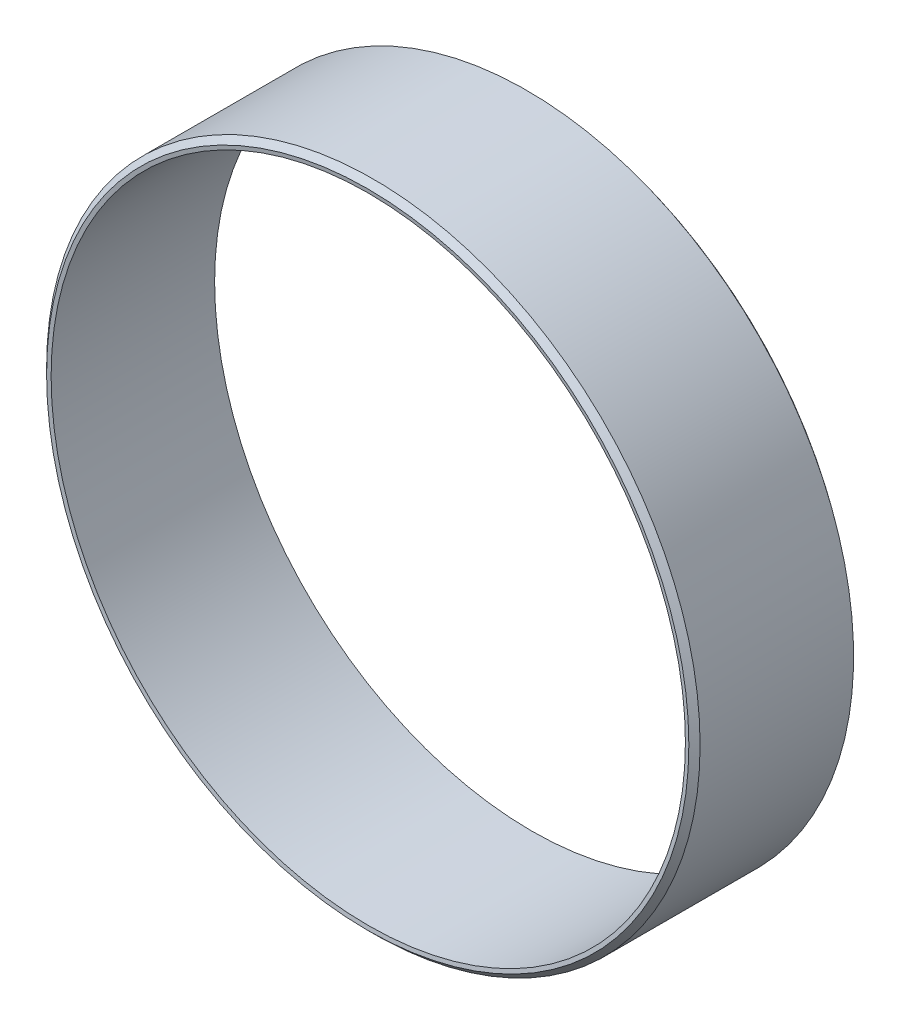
ISO-10303-21;
HEADER;
FILE_DESCRIPTION(('STEP AP214'),'2;1');
FILE_NAME('part.step','',(''),(''),'','','');
FILE_SCHEMA(('AUTOMOTIVE_DESIGN { 1 0 10303 214 1 1 1 1 }'));
ENDSEC;
DATA;
#1=APPLICATION_CONTEXT('core data for automotive mechanical design processes');
#2=APPLICATION_PROTOCOL_DEFINITION('international standard','automotive_design',2000,#1);
#3=PRODUCT_CONTEXT('',#1,'mechanical');
#4=PRODUCT('Part','Part','',(#3));
#5=PRODUCT_RELATED_PRODUCT_CATEGORY('part','',(#4));
#6=PRODUCT_DEFINITION_FORMATION('','',#4);
#7=PRODUCT_DEFINITION_CONTEXT('part definition',#1,'design');
#8=PRODUCT_DEFINITION('design','',#6,#7);
#9=PRODUCT_DEFINITION_SHAPE('','',#8);
#10=(LENGTH_UNIT() NAMED_UNIT(*) SI_UNIT(.MILLI.,.METRE.));
#11=(NAMED_UNIT(*) PLANE_ANGLE_UNIT() SI_UNIT($,.RADIAN.));
#12=(NAMED_UNIT(*) SI_UNIT($,.STERADIAN.) SOLID_ANGLE_UNIT());
#13=UNCERTAINTY_MEASURE_WITH_UNIT(LENGTH_MEASURE(1.E-05),#10,'distance_accuracy_value','');
#14=(GEOMETRIC_REPRESENTATION_CONTEXT(3) GLOBAL_UNCERTAINTY_ASSIGNED_CONTEXT((#13)) GLOBAL_UNIT_ASSIGNED_CONTEXT((#10,
#11,#12)) REPRESENTATION_CONTEXT('',''));
#15=CARTESIAN_POINT('',(0.,0.,0.));
#16=DIRECTION('',(0.,0.,1.));
#17=DIRECTION('',(1.,0.,0.));
#18=AXIS2_PLACEMENT_3D('',#15,#16,#17);
#19=CARTESIAN_POINT('',(0.,0.,139.7));
#20=DIRECTION('',(0.,0.,-1.));
#21=DIRECTION('',(-1.,0.,0.));
#22=AXIS2_PLACEMENT_3D('',#19,#20,#21);
#23=CYLINDRICAL_SURFACE('',#22,161.925);
#24=CARTESIAN_POINT('',(0.,0.,78.5074535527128));
#25=DIRECTION('',(0.,0.,1.));
#26=DIRECTION('',(1.,0.,0.));
#27=AXIS2_PLACEMENT_3D('',#24,#25,#26);
#28=CIRCLE('',#27,161.925);
#29=CARTESIAN_POINT('',(161.925,0.,78.5074535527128));
#30=VERTEX_POINT('',#29);
#31=EDGE_CURVE('E10',#30,#30,#28,.F.);
#32=ORIENTED_EDGE('',*,*,#31,.T.);
#33=EDGE_LOOP('',(#32));
#34=FACE_BOUND('',#33,.T.);
#35=CARTESIAN_POINT('',(0.,0.,2.4362631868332));
#36=DIRECTION('',(0.,0.,-1.));
#37=DIRECTION('',(-1.,0.,0.));
#38=AXIS2_PLACEMENT_3D('',#35,#36,#37);
#39=CIRCLE('',#38,161.925);
#40=CARTESIAN_POINT('',(-161.925,0.,2.4362631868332));
#41=VERTEX_POINT('',#40);
#42=EDGE_CURVE('E75',#41,#41,#39,.T.);
#43=ORIENTED_EDGE('',*,*,#42,.F.);
#44=EDGE_LOOP('',(#43));
#45=FACE_BOUND('',#44,.T.);
#46=ADVANCED_FACE('F32',(#34,#45),#23,.T.);
#47=CARTESIAN_POINT('',(0.,0.,0.));
#48=DIRECTION('',(0.,0.,1.));
#49=DIRECTION('',(1.,0.,0.));
#50=AXIS2_PLACEMENT_3D('',#47,#48,#49);
#51=PLANE('',#50);
#52=CARTESIAN_POINT('',(0.,0.,0.));
#53=DIRECTION('',(0.,0.,1.));
#54=DIRECTION('',(1.,0.,0.));
#55=AXIS2_PLACEMENT_3D('',#52,#53,#54);
#56=CIRCLE('',#55,157.1625);
#57=CARTESIAN_POINT('',(157.1625,0.,0.));
#58=VERTEX_POINT('',#57);
#59=EDGE_CURVE('E43',#58,#58,#56,.T.);
#60=ORIENTED_EDGE('',*,*,#59,.T.);
#61=EDGE_LOOP('',(#60));
#62=FACE_BOUND('',#61,.T.);
#63=CARTESIAN_POINT('',(0.,0.,0.));
#64=DIRECTION('',(0.,0.,-1.));
#65=DIRECTION('',(-1.,0.,0.));
#66=AXIS2_PLACEMENT_3D('',#63,#64,#65);
#67=CIRCLE('',#66,158.75);
#68=CARTESIAN_POINT('',(-158.75,0.,0.));
#69=VERTEX_POINT('',#68);
#70=EDGE_CURVE('E51',#69,#69,#67,.T.);
#71=ORIENTED_EDGE('',*,*,#70,.T.);
#72=EDGE_LOOP('',(#71));
#73=FACE_BOUND('',#72,.T.);
#74=ADVANCED_FACE('F65',(#62,#73),#51,.F.);
#75=CARTESIAN_POINT('',(0.,0.,139.7));
#76=DIRECTION('',(0.,0.,-1.));
#77=DIRECTION('',(-1.,0.,0.));
#78=AXIS2_PLACEMENT_3D('',#75,#76,#77);
#79=CYLINDRICAL_SURFACE('',#78,157.1625);
#80=ORIENTED_EDGE('',*,*,#59,.F.);
#81=EDGE_LOOP('',(#80));
#82=FACE_BOUND('',#81,.T.);
#83=CARTESIAN_POINT('',(0.,0.,81.0256100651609));
#84=DIRECTION('',(0.,0.,-1.));
#85=DIRECTION('',(-1.,0.,0.));
#86=AXIS2_PLACEMENT_3D('',#83,#84,#85);
#87=CIRCLE('',#86,157.1625);
#88=CARTESIAN_POINT('',(-157.1625,0.,81.0256100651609));
#89=VERTEX_POINT('',#88);
#90=EDGE_CURVE('E47',#89,#89,#87,.F.);
#91=ORIENTED_EDGE('',*,*,#90,.T.);
#92=EDGE_LOOP('',(#91));
#93=FACE_BOUND('',#92,.T.);
#94=ADVANCED_FACE('F62',(#82,#93),#79,.F.);
#95=CARTESIAN_POINT('',(0.,0.,370.55044));
#96=DIRECTION('',(0.,1.,0.));
#97=DIRECTION('',(-1.,0.,0.));
#98=AXIS2_PLACEMENT_3D('',#95,#96,#97);
#99=ELLIPSE('',#98,599.9988,299.9994);
#100=TRIMMED_CURVE('',#99,(PARAMETER_VALUE(1.5707963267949)),
(PARAMETER_VALUE(4.71238898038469)),.T.,.PARAMETER.);
#101=CARTESIAN_POINT('',(0.,0.,-155.268637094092));
#102=DIRECTION('',(0.,0.,-1.));
#103=AXIS1_PLACEMENT('',#101,#102);
#104=SURFACE_OF_REVOLUTION('',#100,#103);
#105=CARTESIAN_POINT('',(0.,0.,81.2953827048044));
#106=DIRECTION('',(0.,0.,-1.));
#107=DIRECTION('',(-1.,0.,0.));
#108=AXIS2_PLACEMENT_3D('',#105,#106,#107);
#109=CIRCLE('',#108,159.137070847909);
#110=CARTESIAN_POINT('',(-159.137070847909,0.,81.2953827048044));
#111=VERTEX_POINT('',#110);
#112=EDGE_CURVE('E39',#111,#111,#109,.F.);
#113=ORIENTED_EDGE('',*,*,#112,.T.);
#114=EDGE_LOOP('',(#113));
#115=FACE_BOUND('',#114,.T.);
#116=ORIENTED_EDGE('',*,*,#90,.F.);
#117=EDGE_LOOP('',(#116));
#118=FACE_BOUND('',#117,.T.);
#119=ADVANCED_FACE('F57',(#115,#118),#104,.F.);
#120=CARTESIAN_POINT('',(0.,0.,0.));
#121=DIRECTION('',(0.,0.,1.));
#122=DIRECTION('',(1.,0.,0.));
#123=AXIS2_PLACEMENT_3D('',#120,#121,#122);
#124=CONICAL_SURFACE('',#123,158.75,0.91629785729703);
#125=ORIENTED_EDGE('',*,*,#42,.T.);
#126=EDGE_LOOP('',(#125));
#127=FACE_BOUND('',#126,.T.);
#128=ORIENTED_EDGE('',*,*,#70,.F.);
#129=EDGE_LOOP('',(#128));
#130=FACE_BOUND('',#129,.T.);
#131=ADVANCED_FACE('F61',(#127,#130),#124,.T.);
#132=CARTESIAN_POINT('',(0.,0.,81.2953827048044));
#133=DIRECTION('',(0.,0.,-1.));
#134=DIRECTION('',(-1.,0.,0.));
#135=AXIS2_PLACEMENT_3D('',#132,#133,#134);
#136=CONICAL_SURFACE('',#135,159.137070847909,0.785398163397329);
#137=ORIENTED_EDGE('',*,*,#31,.F.);
#138=EDGE_LOOP('',(#137));
#139=FACE_BOUND('',#138,.T.);
#140=ORIENTED_EDGE('',*,*,#112,.F.);
#141=EDGE_LOOP('',(#140));
#142=FACE_BOUND('',#141,.T.);
#143=ADVANCED_FACE('F34',(#139,#142),#136,.T.);
#144=CLOSED_SHELL('',(#46,#74,#94,#119,#131,#143));
#145=MANIFOLD_SOLID_BREP('B2',#144);
#146=ADVANCED_BREP_SHAPE_REPRESENTATION('',(#18,#145),#14);
#147=SHAPE_DEFINITION_REPRESENTATION(#9,#146);
ENDSEC;
END-ISO-10303-21;
